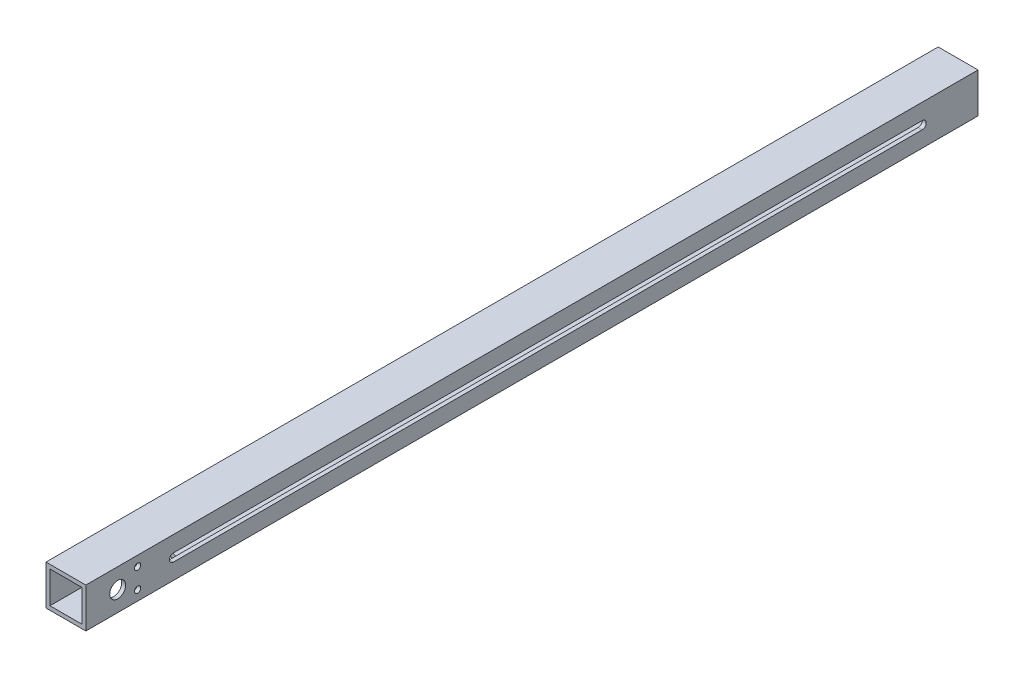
from build123d import *

# Parameters (mm, degrees)
SKETCH1_W           = 31.75
SKETCH1_H           = 31.75
SKETCH1_W_2         = 25.4
SKETCH1_H_2         = 25.4
BOSS_EXTRUDE1_DEPTH = 711.2
SKETCH2_R           = 6.35
SKETCH2_R_2         = 2.4892
CUT_EXTRUDE1_DEPTH  = 713.085330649
CUT_EXTRUDE2_DEPTH  = 3.175
SKETCH4_W           = 88.9
SKETCH4_H           = 25.4
CUT_EXTRUDE3_DEPTH  = 3.175
CUT_EXTRUDE4_REACH  = 714.085
FILLET1_R           = 6.35


with BuildPart() as part:
    # Sketch1 → Boss-Extrude1 (new body)
    with BuildSketch(Plane.XY):
        Rectangle(SKETCH1_W, SKETCH1_H)
        Rectangle(SKETCH1_W_2, SKETCH1_H_2, mode=Mode.SUBTRACT)
    extrude(amount=-BOSS_EXTRUDE1_DEPTH)

    # Sketch2 → Cut-Extrude1 (cut, through all)
    with BuildSketch(Plane(origin=(15.875, 0, 0), x_dir=(0, 0, -1), z_dir=(1, 0, 0))):
        with Locations(Location((25.4, 0, 0), (0, 0, 90))):
            Circle(SKETCH2_R)
        with Locations(Location((41.275, 7.9375, 0), (0, 0, 90))):
            Circle(SKETCH2_R_2)
        with Locations(Location((41.275, -7.9375, 0), (0, 0, 90))):
            Circle(SKETCH2_R_2)
    extrude(amount=-CUT_EXTRUDE1_DEPTH, mode=Mode.SUBTRACT)

    # Sketch3 → Cut-Extrude2 (cut)
    with BuildSketch(Plane(origin=(15.875, 0, 0), x_dir=(0, 0, -1), z_dir=(1, 0, 0))):
        with BuildLine():
            Line((69.85, 3.175), (666.75, 3.175))
            ThreePointArc((666.75, 3.175), (669.925, 0), (666.75, -3.175))
            Line((666.75, -3.175), (69.85, -3.175))
            ThreePointArc((69.85, -3.175), (66.675, 0), (69.85, 3.175))
        make_face()
    extrude(amount=-CUT_EXTRUDE2_DEPTH, mode=Mode.SUBTRACT)

    # Sketch4 → Cut-Extrude3 (cut)
    with BuildSketch(Plane.ZY.offset(15.875)):
        with Locations((-666.75, 0)):
            Rectangle(SKETCH4_W, SKETCH4_H)
    extrude(amount=-CUT_EXTRUDE3_DEPTH, mode=Mode.SUBTRACT)

    # Sketch6 → Cut-Extrude4 (cut, up to next)
    with BuildSketch(Plane.XZ.offset(15.875), mode=Mode.PRIVATE) as cut_extrude4_sk1:
        with BuildLine():
            Line((8.89, -25.4), (8.89, -76.2))
            ThreePointArc((8.89, -76.2), (0, -85.09), (-8.89, -76.2))
            Line((-8.89, -76.2), (-8.89, -25.4))
            ThreePointArc((-8.89, -25.4), (0, -16.51), (8.89, -25.4))
        make_face()
    cut_extrude4_tool1 = extrude(cut_extrude4_sk1.sketch, amount=-CUT_EXTRUDE4_REACH, mode=Mode.PRIVATE) & part.part
    add(cut_extrude4_tool1.solids().sort_by_distance((0, -15.875, -50.8))[0], mode=Mode.SUBTRACT)

    # Fillet1
    fillet1_edges = [part.edges().sort_by_distance(p)[0] for p in [
        (-14.2875, 12.7, -622.3),
        (-14.2875, -12.7, -622.3),
    ]]
    fillet(fillet1_edges, radius=FILLET1_R)


solid = part.part
